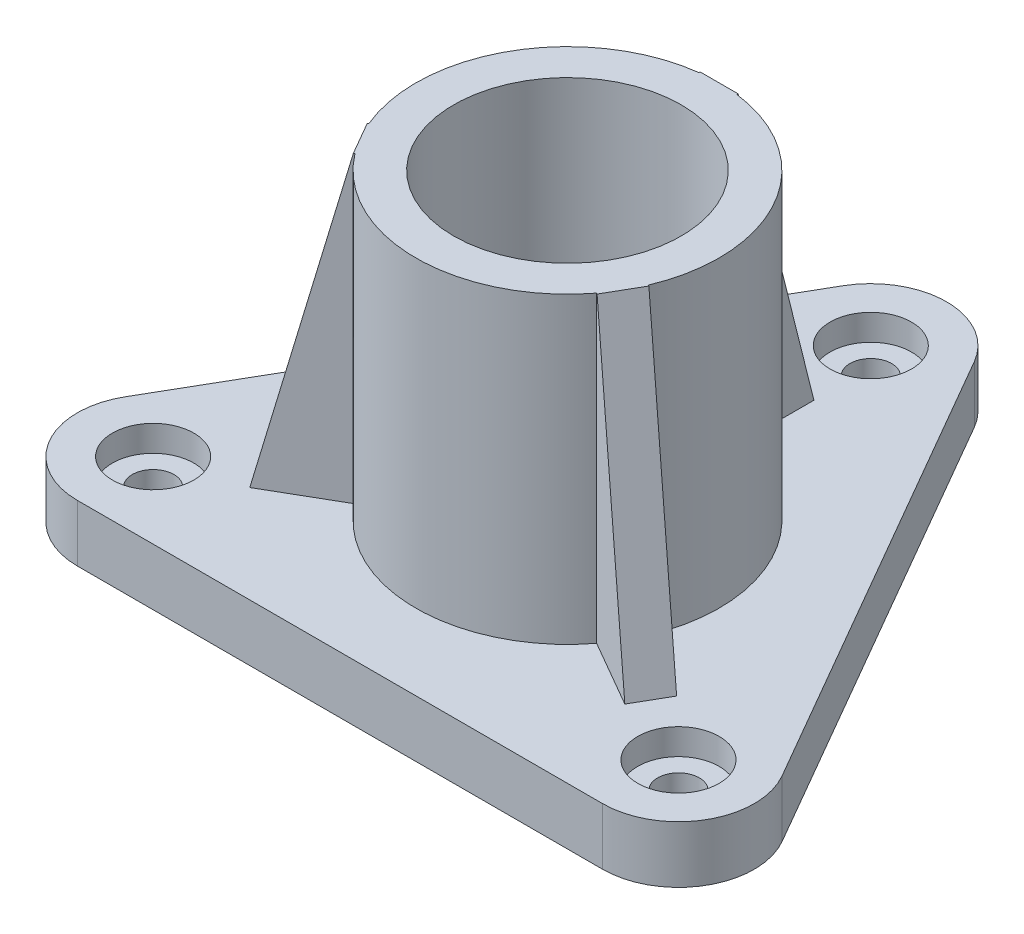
from build123d import *

# Parameters (mm, degrees)
SKETCH1_R                                = 30
EXTRUDE1_DEPTH                           = 15
SKETCH2_R                                = 40
SKETCH2_R_2                              = 30
EXTRUDE2_DEPTH                           = 80
CBORE_FOR_M10_HEX_HEAD_BOLT1_D           = 11
CBORE_FOR_M10_HEX_HEAD_BOLT1_CBORE_D     = 21.48
CBORE_FOR_M10_HEX_HEAD_BOLT1_CBORE_DEPTH = 6.85
EXTRUDE3_DEPTH                           = 5
CIRPATTERN1_COUNT                        = 3


with BuildPart() as part:
    # Sketch1 → Extrude1 (new body)
    with BuildSketch(Plane(origin=(0, 0, 0), x_dir=(1, 0, 0), z_dir=(0, 1, 0))):
        with BuildLine():
            Line((-17.320508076, 90), (-86.602540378, -30))
            ThreePointArc((-86.602540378, -30), (-86.602540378, -50), (-69.282032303, -60))
            Line((-69.282032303, -60), (69.282032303, -60))
            ThreePointArc((69.282032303, -60), (86.602540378, -50), (86.602540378, -30))
            Line((86.602540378, -30), (17.320508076, 90))
            ThreePointArc((17.320508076, 90), (0, 100), (-17.320508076, 90))
        make_face()
        with Locations(Location((0, 0, 0), (0, 0, 270))):
            Circle(SKETCH1_R, mode=Mode.SUBTRACT)
    extrude(amount=EXTRUDE1_DEPTH)

    # Sketch2 → Extrude2 (add)
    with BuildSketch(Plane(origin=(0, 15, 0), x_dir=(-1, 0, 0), z_dir=(0, 1, 0))):
        with Locations(Location((0, 0, 0), (0, 0, 270))):
            Circle(SKETCH2_R)
        with Locations(Location((0, 0, 0), (0, 0, 90))):
            Circle(SKETCH2_R_2, mode=Mode.SUBTRACT)
    extrude(amount=EXTRUDE2_DEPTH)

    # CBORE for M10 Hex Head Bolt1 (through all)
    with Locations(Plane(origin=(0, 15, 0), x_dir=(-1, 0, 0), z_dir=(0, 1, 0))):
        with Locations((69.282032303, 40), (0, -80), (-69.282032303, 40)):
            CounterBoreHole(CBORE_FOR_M10_HEX_HEAD_BOLT1_D / 2, CBORE_FOR_M10_HEX_HEAD_BOLT1_CBORE_D / 2, CBORE_FOR_M10_HEX_HEAD_BOLT1_CBORE_DEPTH)

    # Sketch3 → Extrude3 (add, symmetric)
    with BuildSketch(Plane(origin=(0, 0, 0), x_dir=(0, 0, -1), z_dir=(1, 0, 0))):
        Polygon((40, 95), (60, 15), (30, 15), (30, 95), align=None)
    extrude3 = extrude(amount=EXTRUDE3_DEPTH, both=True)

    # CirPattern1: Extrude3 ×3 about axis
    cirpattern1_axis = Axis((0, 0, 0), (0, 1, 0))
    for i in range(1, CIRPATTERN1_COUNT):
        add(extrude3.rotate(cirpattern1_axis, i * 360 / CIRPATTERN1_COUNT))


solid = part.part
